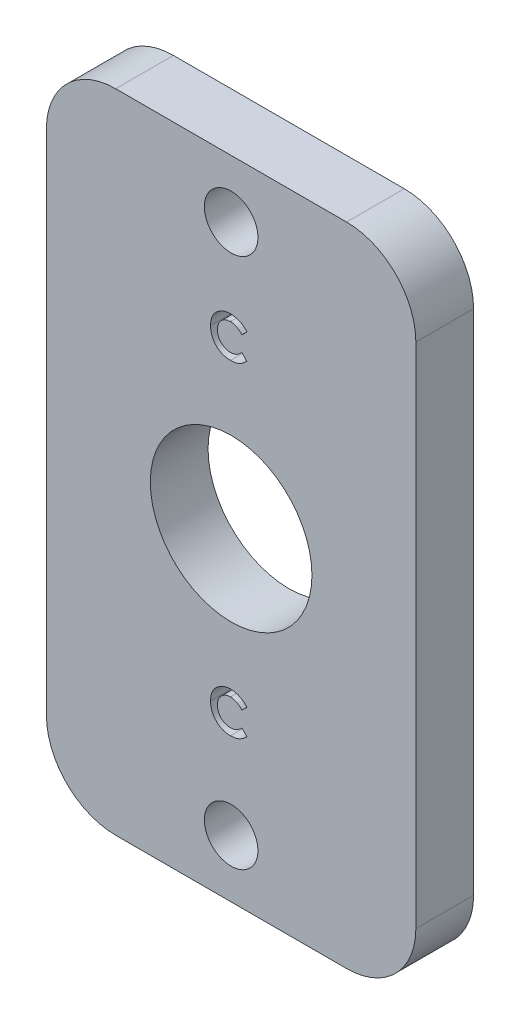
from build123d import *

# Parameters (mm, degrees)
SKETCH2_W                 = 20.32
SKETCH2_H                 = 35.56
SKETCH2_R                 = 4.445
BOSS_EXTRUDE1_DEPTH       = 3.175
F_4_CLEARANCE_HOLE1_D     = 2.9464
F_4_CLEARANCE_HOLE1_DEPTH = 3.302
FILLET1_R                 = 3.81
CUT_EXTRUDE1_DEPTH        = 42.079150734


with BuildPart() as part:
    # Sketch2 → Boss-Extrude1 (new body)
    with BuildSketch(Plane.XY):
        with Locations((10.16, 17.78)):
            Rectangle(SKETCH2_W, SKETCH2_H)
        with Locations((10.16, 17.78)):
            Circle(SKETCH2_R, mode=Mode.SUBTRACT)
    extrude(amount=BOSS_EXTRUDE1_DEPTH)

    # 4 Clearance Hole1
    with Locations(Plane.XY.offset(3.175)):
        with Locations((10.16, 3.175), (10.16, 32.385)):
            Hole(F_4_CLEARANCE_HOLE1_D / 2, depth=F_4_CLEARANCE_HOLE1_DEPTH)

    # Fillet1
    fillet1_edges = [part.edges().sort_by_distance(p)[0] for p in [
        (0, 35.56, 1.5875),
        (20.32, 35.56, 1.5875),
        (20.32, 0, 1.5875),
        (0, 0, 1.5875),
    ]]
    fillet(fillet1_edges, radius=FILLET1_R)

    # Sketch5 → Cut-Extrude1 (cut, through all)
    with BuildSketch(Plane.XY.offset(3.175)):
        with BuildLine():
            Line((11.033803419, 27.581290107), (10.755227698, 27.315010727))
            add(Edge.make_bspline(
                [(10.755227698, 27.315010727), (10.731596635, 27.339445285), (10.685437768, 27.387173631), (10.611058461, 27.450361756), (10.53370669, 27.503020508), (10.454887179, 27.547369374), (10.373182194, 27.580922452), (10.289536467, 27.605373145), (10.203415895, 27.620279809), (10.145132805, 27.621985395), (10.115817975, 27.622843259)],
                knots=[0, 0, 0, 0, 1.115251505, 2.178435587, 3.19620269, 4.182487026, 5.141301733, 6.088180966, 7.038406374, 8, 8, 8, 8], degree=3))
            add(Edge.make_bspline(
                [(10.115817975, 27.622843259), (10.091336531, 27.622165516), (10.043025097, 27.620828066), (9.972091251, 27.611023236), (9.904239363, 27.594349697), (9.839237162, 27.571370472), (9.777275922, 27.541636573), (9.718225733, 27.505171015), (9.662232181, 27.462303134), (9.610034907, 27.41325473), (9.562286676, 27.359665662), (9.520098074, 27.302486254), (9.484758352, 27.241847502), (9.455755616, 27.178363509), (9.433163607, 27.111740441), (9.417030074, 27.042023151), (9.407698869, 26.96912861), (9.406306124, 26.919575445), (9.405598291, 26.894391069)],
                knots=[0, 0, 0, 0, 1.035432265, 2.043311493, 3.022114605, 3.98653278, 4.95457646, 5.923598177, 6.917315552, 7.932509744, 8.948865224, 9.949768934, 10.933144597, 11.912367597, 12.897413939, 13.903909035, 14.934704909, 16, 16, 16, 16], degree=3))
            add(Edge.make_bspline(
                [(9.405598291, 26.894391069), (9.40580228, 26.876714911), (9.406204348, 26.841874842), (9.410605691, 26.790336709), (9.417692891, 26.740332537), (9.427949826, 26.691938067), (9.440776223, 26.645111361), (9.455824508, 26.599448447), (9.47470236, 26.555580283), (9.49565706, 26.512997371), (9.520027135, 26.472861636), (9.546302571, 26.434588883), (9.574793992, 26.398366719), (9.605685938, 26.364343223), (9.639413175, 26.333050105), (9.675103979, 26.303546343), (9.713360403, 26.276570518), (9.753387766, 26.251445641), (9.795531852, 26.229619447), (9.838649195, 26.209849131), (9.883393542, 26.193792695), (9.929220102, 26.180849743), (9.975965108, 26.169843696), (10.024085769, 26.163066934), (10.07316494, 26.157934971), (10.106334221, 26.157618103), (10.123026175, 26.157458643)],
                knots=[0, 0, 0, 0, 1.103660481, 2.175337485, 3.227646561, 4.255952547, 5.262355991, 6.258840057, 7.255597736, 8.242457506, 9.22035537, 10.185017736, 11.140346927, 12.096287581, 13.051739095, 14.01125915, 14.986044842, 15.97314143, 16.960198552, 17.947847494, 18.933482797, 19.925264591, 20.920966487, 21.929612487, 22.958107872, 24, 24, 24, 24], degree=3))
            add(Edge.make_bspline(
                [(10.123026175, 26.157458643), (10.151338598, 26.158277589), (10.206965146, 26.159886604), (10.288605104, 26.172468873), (10.36639985, 26.193165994), (10.42855748, 26.217608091), (10.477256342, 26.241744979), (10.514330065, 26.264070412), (10.552667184, 26.28904386), (10.591630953, 26.317607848), (10.631659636, 26.349419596), (10.672046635, 26.385175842), (10.713825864, 26.423699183), (10.741195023, 26.451194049), (10.755227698, 26.465291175)],
                knots=[0, 0, 0, 0, 1.404581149, 2.759636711, 4.088442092, 5.392261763, 6.066678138, 6.783632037, 7.538459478, 8.336747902, 9.180226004, 10.074962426, 11.012997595, 12, 12, 12, 12], degree=3))
            Line((10.755227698, 26.465291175), (11.025323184, 26.181627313))
            add(Edge.make_bspline(
                [(11.025323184, 26.181627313), (11.006336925, 26.163296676), (10.969279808, 26.127519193), (10.913380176, 26.076718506), (10.857550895, 26.031068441), (10.803140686, 25.988912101), (10.749258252, 25.951477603), (10.695909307, 25.918727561), (10.643697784, 25.889833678), (10.591539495, 25.865283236), (10.539109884, 25.84443736), (10.485165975, 25.82649043), (10.429542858, 25.811307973), (10.37190081, 25.799057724), (10.312777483, 25.789234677), (10.251619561, 25.782604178), (10.188814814, 25.778146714), (10.146213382, 25.777746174), (10.124722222, 25.777544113)],
                knots=[0, 0, 0, 0, 1.244526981, 2.429050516, 3.560637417, 4.644440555, 5.67424972, 6.652764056, 7.595344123, 8.486817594, 9.369275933, 10.254498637, 11.166417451, 12.086725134, 13.032340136, 13.991389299, 14.986715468, 16, 16, 16, 16], degree=3))
            add(Edge.make_bspline(
                [(10.124722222, 25.777544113), (10.085245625, 25.778550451), (10.008000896, 25.780519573), (9.89480076, 25.795109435), (9.78726367, 25.819569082), (9.685128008, 25.854161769), (9.58842625, 25.898352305), (9.497183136, 25.952527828), (9.41154573, 26.016544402), (9.332205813, 26.089651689), (9.260439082, 26.17039255), (9.197005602, 26.257086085), (9.144533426, 26.35015836), (9.100964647, 26.448234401), (9.066894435, 26.551761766), (9.042914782, 26.66085244), (9.028126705, 26.775401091), (9.026508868, 26.853640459), (9.025683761, 26.893543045)],
                knots=[0, 0, 0, 0, 1.078019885, 2.10938526, 3.111377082, 4.085535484, 5.04941344, 6.010039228, 6.978205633, 7.964457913, 8.951525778, 9.924444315, 10.892603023, 11.863865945, 12.85144698, 13.863884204, 14.910567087, 16, 16, 16, 16], degree=3))
            add(Edge.make_bspline(
                [(9.025683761, 26.893543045), (9.026032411, 26.919567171), (9.026723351, 26.971140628), (9.033985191, 27.047112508), (9.044108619, 27.121171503), (9.060168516, 27.192548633), (9.079527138, 27.26220548), (9.103602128, 27.329384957), (9.132355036, 27.394280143), (9.164859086, 27.456999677), (9.201630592, 27.517132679), (9.242708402, 27.574162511), (9.287035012, 27.628529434), (9.335675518, 27.679512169), (9.38792311, 27.727558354), (9.444013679, 27.772407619), (9.50360987, 27.814703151), (9.566872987, 27.853354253), (9.632573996, 27.888316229), (9.699884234, 27.919154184), (9.768638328, 27.944927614), (9.83854558, 27.966305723), (9.909901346, 27.98226297), (9.982196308, 27.994342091), (10.056045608, 28.001094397), (10.105629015, 28.002199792), (10.130658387, 28.002757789)],
                knots=[0, 0, 0, 0, 1.071919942, 2.124283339, 3.142214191, 4.149696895, 5.136002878, 6.119640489, 7.086990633, 8.058538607, 9.028339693, 9.988281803, 10.952401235, 11.916291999, 12.888973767, 13.874849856, 14.873389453, 15.898127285, 16.927174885, 17.938320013, 18.946391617, 19.950418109, 20.947802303, 21.956882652, 22.968648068, 24, 24, 24, 24], degree=3))
            add(Edge.make_bspline(
                [(10.130658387, 28.002757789), (10.152011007, 28.002437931), (10.19449424, 28.001801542), (10.257758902, 27.996496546), (10.320517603, 27.988165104), (10.382545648, 27.975594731), (10.444286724, 27.960672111), (10.504929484, 27.941132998), (10.565430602, 27.919352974), (10.624841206, 27.893319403), (10.683244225, 27.864901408), (10.739271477, 27.832660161), (10.793863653, 27.798579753), (10.845811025, 27.760643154), (10.896086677, 27.720226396), (10.944427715, 27.677140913), (10.990409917, 27.630668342), (11.019265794, 27.597832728), (11.033803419, 27.581290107)],
                knots=[0, 0, 0, 0, 0.996412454, 1.982464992, 2.961075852, 3.949442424, 4.934965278, 5.923860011, 6.921385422, 7.934793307, 8.949617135, 9.951082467, 10.950285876, 11.951772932, 12.951063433, 13.960125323, 14.972308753, 16, 16, 16, 16], degree=3))
        make_face()
        with BuildLine():
            Line((11.033803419, 9.700191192), (10.755227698, 9.433911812))
            add(Edge.make_bspline(
                [(10.755227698, 9.433911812), (10.731596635, 9.45834637), (10.685437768, 9.506074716), (10.611058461, 9.569262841), (10.53370669, 9.621921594), (10.454887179, 9.66627046), (10.373182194, 9.699823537), (10.289536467, 9.72427423), (10.203415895, 9.739180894), (10.145132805, 9.74088648), (10.115817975, 9.741744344)],
                knots=[0, 0, 0, 0, 1.115251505, 2.178435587, 3.19620269, 4.182487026, 5.141301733, 6.088180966, 7.038406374, 8, 8, 8, 8], degree=3))
            add(Edge.make_bspline(
                [(10.115817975, 9.741744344), (10.091336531, 9.741066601), (10.043025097, 9.739729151), (9.972091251, 9.729924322), (9.904239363, 9.713250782), (9.839237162, 9.690271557), (9.777275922, 9.660537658), (9.718225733, 9.624072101), (9.662232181, 9.581204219), (9.610034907, 9.532155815), (9.562286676, 9.478566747), (9.520098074, 9.421387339), (9.484758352, 9.360748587), (9.455755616, 9.297264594), (9.433163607, 9.230641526), (9.417030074, 9.160924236), (9.407698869, 9.088029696), (9.406306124, 9.03847653), (9.405598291, 9.013292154)],
                knots=[0, 0, 0, 0, 1.035432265, 2.043311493, 3.022114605, 3.98653278, 4.95457646, 5.923598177, 6.917315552, 7.932509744, 8.948865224, 9.949768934, 10.933144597, 11.912367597, 12.897413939, 13.903909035, 14.934704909, 16, 16, 16, 16], degree=3))
            add(Edge.make_bspline(
                [(9.405598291, 9.013292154), (9.40580228, 8.995615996), (9.406204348, 8.960775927), (9.410605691, 8.909237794), (9.417692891, 8.859233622), (9.427949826, 8.810839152), (9.440776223, 8.764012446), (9.455824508, 8.718349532), (9.47470236, 8.674481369), (9.49565706, 8.631898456), (9.520027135, 8.591762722), (9.546302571, 8.553489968), (9.574793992, 8.517267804), (9.605685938, 8.483244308), (9.639413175, 8.45195119), (9.675103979, 8.422447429), (9.713360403, 8.395471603), (9.753387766, 8.370346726), (9.795531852, 8.348520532), (9.838649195, 8.328750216), (9.883393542, 8.31269378), (9.929220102, 8.299750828), (9.975965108, 8.288744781), (10.024085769, 8.281968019), (10.07316494, 8.276836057), (10.106334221, 8.276519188), (10.123026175, 8.276359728)],
                knots=[0, 0, 0, 0, 1.103660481, 2.175337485, 3.227646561, 4.255952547, 5.262355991, 6.258840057, 7.255597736, 8.242457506, 9.22035537, 10.185017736, 11.140346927, 12.096287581, 13.051739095, 14.01125915, 14.986044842, 15.97314143, 16.960198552, 17.947847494, 18.933482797, 19.925264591, 20.920966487, 21.929612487, 22.958107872, 24, 24, 24, 24], degree=3))
            add(Edge.make_bspline(
                [(10.123026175, 8.276359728), (10.151338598, 8.277178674), (10.206965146, 8.278787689), (10.288605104, 8.291369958), (10.36639985, 8.312067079), (10.42855748, 8.336509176), (10.477256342, 8.360646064), (10.514330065, 8.382971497), (10.552667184, 8.407944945), (10.591630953, 8.436508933), (10.631659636, 8.468320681), (10.672046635, 8.504076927), (10.713825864, 8.542600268), (10.741195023, 8.570095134), (10.755227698, 8.584192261)],
                knots=[0, 0, 0, 0, 1.404581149, 2.759636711, 4.088442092, 5.392261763, 6.066678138, 6.783632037, 7.538459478, 8.336747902, 9.180226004, 10.074962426, 11.012997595, 12, 12, 12, 12], degree=3))
            Line((10.755227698, 8.584192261), (11.025323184, 8.300528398))
            add(Edge.make_bspline(
                [(11.025323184, 8.300528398), (11.006336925, 8.282197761), (10.969279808, 8.246420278), (10.913380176, 8.195619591), (10.857550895, 8.149969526), (10.803140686, 8.107813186), (10.749258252, 8.070378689), (10.695909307, 8.037628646), (10.643697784, 8.008734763), (10.591539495, 7.984184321), (10.539109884, 7.963338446), (10.485165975, 7.945391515), (10.429542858, 7.930209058), (10.37190081, 7.917958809), (10.312777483, 7.908135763), (10.251619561, 7.901505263), (10.188814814, 7.897047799), (10.146213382, 7.896647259), (10.124722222, 7.896445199)],
                knots=[0, 0, 0, 0, 1.244526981, 2.429050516, 3.560637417, 4.644440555, 5.67424972, 6.652764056, 7.595344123, 8.486817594, 9.369275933, 10.254498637, 11.166417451, 12.086725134, 13.032340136, 13.991389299, 14.986715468, 16, 16, 16, 16], degree=3))
            add(Edge.make_bspline(
                [(10.124722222, 7.896445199), (10.085245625, 7.897451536), (10.008000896, 7.899420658), (9.89480076, 7.91401052), (9.78726367, 7.938470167), (9.685128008, 7.973062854), (9.58842625, 8.017253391), (9.497183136, 8.071428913), (9.41154573, 8.135445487), (9.332205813, 8.208552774), (9.260439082, 8.289293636), (9.197005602, 8.37598717), (9.144533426, 8.469059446), (9.100964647, 8.567135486), (9.066894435, 8.670662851), (9.042914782, 8.779753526), (9.028126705, 8.894302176), (9.026508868, 8.972541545), (9.025683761, 9.01244413)],
                knots=[0, 0, 0, 0, 1.078019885, 2.10938526, 3.111377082, 4.085535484, 5.04941344, 6.010039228, 6.978205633, 7.964457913, 8.951525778, 9.924444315, 10.892603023, 11.863865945, 12.85144698, 13.863884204, 14.910567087, 16, 16, 16, 16], degree=3))
            add(Edge.make_bspline(
                [(9.025683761, 9.01244413), (9.026032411, 9.038468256), (9.026723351, 9.090041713), (9.033985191, 9.166013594), (9.044108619, 9.240072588), (9.060168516, 9.311449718), (9.079527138, 9.381106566), (9.103602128, 9.448286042), (9.132355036, 9.513181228), (9.164859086, 9.575900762), (9.201630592, 9.636033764), (9.242708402, 9.693063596), (9.287035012, 9.747430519), (9.335675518, 9.798413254), (9.38792311, 9.84645944), (9.444013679, 9.891308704), (9.50360987, 9.933604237), (9.566872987, 9.972255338), (9.632573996, 10.007217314), (9.699884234, 10.03805527), (9.768638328, 10.063828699), (9.83854558, 10.085206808), (9.909901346, 10.101164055), (9.982196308, 10.113243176), (10.056045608, 10.119995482), (10.105629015, 10.121100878), (10.130658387, 10.121658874)],
                knots=[0, 0, 0, 0, 1.071919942, 2.124283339, 3.142214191, 4.149696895, 5.136002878, 6.119640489, 7.086990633, 8.058538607, 9.028339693, 9.988281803, 10.952401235, 11.916291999, 12.888973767, 13.874849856, 14.873389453, 15.898127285, 16.927174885, 17.938320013, 18.946391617, 19.950418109, 20.947802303, 21.956882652, 22.968648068, 24, 24, 24, 24], degree=3))
            add(Edge.make_bspline(
                [(10.130658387, 10.121658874), (10.152011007, 10.121339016), (10.19449424, 10.120702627), (10.257758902, 10.115397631), (10.320517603, 10.107066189), (10.382545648, 10.094495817), (10.444286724, 10.079573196), (10.504929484, 10.060034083), (10.565430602, 10.038254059), (10.624841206, 10.012220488), (10.683244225, 9.983802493), (10.739271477, 9.951561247), (10.793863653, 9.917480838), (10.845811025, 9.879544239), (10.896086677, 9.839127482), (10.944427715, 9.796041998), (10.990409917, 9.749569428), (11.019265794, 9.716733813), (11.033803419, 9.700191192)],
                knots=[0, 0, 0, 0, 0.996412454, 1.982464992, 2.961075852, 3.949442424, 4.934965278, 5.923860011, 6.921385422, 7.934793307, 8.949617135, 9.951082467, 10.950285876, 11.951772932, 12.951063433, 13.960125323, 14.972308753, 16, 16, 16, 16], degree=3))
        make_face()
    extrude(amount=-CUT_EXTRUDE1_DEPTH, mode=Mode.SUBTRACT)


solid = part.part
